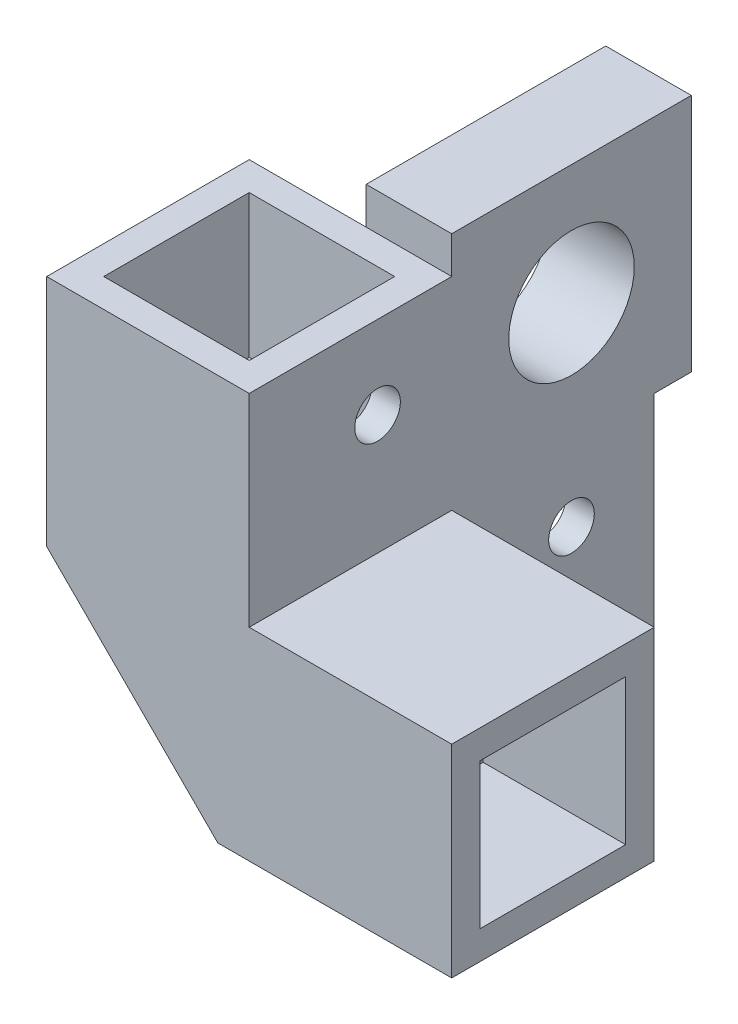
ISO-10303-21;
HEADER;
FILE_DESCRIPTION(('STEP AP214'),'2;1');
FILE_NAME('part.step','',(''),(''),'','','');
FILE_SCHEMA(('AUTOMOTIVE_DESIGN { 1 0 10303 214 1 1 1 1 }'));
ENDSEC;
DATA;
#1=APPLICATION_CONTEXT('core data for automotive mechanical design processes');
#2=APPLICATION_PROTOCOL_DEFINITION('international standard','automotive_design',2000,#1);
#3=PRODUCT_CONTEXT('',#1,'mechanical');
#4=PRODUCT('Part','Part','',(#3));
#5=PRODUCT_RELATED_PRODUCT_CATEGORY('part','',(#4));
#6=PRODUCT_DEFINITION_FORMATION('','',#4);
#7=PRODUCT_DEFINITION_CONTEXT('part definition',#1,'design');
#8=PRODUCT_DEFINITION('design','',#6,#7);
#9=PRODUCT_DEFINITION_SHAPE('','',#8);
#10=(LENGTH_UNIT() NAMED_UNIT(*) SI_UNIT(.MILLI.,.METRE.));
#11=(NAMED_UNIT(*) PLANE_ANGLE_UNIT() SI_UNIT($,.RADIAN.));
#12=(NAMED_UNIT(*) SI_UNIT($,.STERADIAN.) SOLID_ANGLE_UNIT());
#13=UNCERTAINTY_MEASURE_WITH_UNIT(LENGTH_MEASURE(1.E-05),#10,'distance_accuracy_value','');
#14=(GEOMETRIC_REPRESENTATION_CONTEXT(3) GLOBAL_UNCERTAINTY_ASSIGNED_CONTEXT((#13)) GLOBAL_UNIT_ASSIGNED_CONTEXT((#10,
#11,#12)) REPRESENTATION_CONTEXT('',''));
#15=CARTESIAN_POINT('',(0.,0.,0.));
#16=DIRECTION('',(0.,0.,1.));
#17=DIRECTION('',(1.,0.,0.));
#18=AXIS2_PLACEMENT_3D('',#15,#16,#17);
#19=CARTESIAN_POINT('',(0.,35.5,0.));
#20=DIRECTION('',(0.,-1.,0.));
#21=DIRECTION('',(0.,0.,-1.));
#22=AXIS2_PLACEMENT_3D('',#19,#20,#21);
#23=PLANE('',#22);
#24=DIRECTION('',(0.,0.,-1.));
#25=VECTOR('',#24,1.);
#26=CARTESIAN_POINT('',(2.75,35.5,-17.75));
#27=LINE('',#26,#25);
#28=CARTESIAN_POINT('',(2.75,35.5,-17.75));
#29=VERTEX_POINT('',#28);
#30=CARTESIAN_POINT('',(2.75,35.5,-53.25));
#31=VERTEX_POINT('',#30);
#32=EDGE_CURVE('E211',#29,#31,#27,.T.);
#33=ORIENTED_EDGE('',*,*,#32,.T.);
#34=DIRECTION('',(-1.,0.,0.));
#35=VECTOR('',#34,1.);
#36=CARTESIAN_POINT('',(-17.75,35.5,-53.25));
#37=LINE('',#36,#35);
#38=CARTESIAN_POINT('',(-17.75,35.5,-53.25));
#39=VERTEX_POINT('',#38);
#40=EDGE_CURVE('E254',#31,#39,#37,.T.);
#41=ORIENTED_EDGE('',*,*,#40,.T.);
#42=DIRECTION('',(0.,0.,1.));
#43=VECTOR('',#42,1.);
#44=CARTESIAN_POINT('',(-17.75,35.5,-17.75));
#45=LINE('',#44,#43);
#46=CARTESIAN_POINT('',(-17.75,35.5,-17.75));
#47=VERTEX_POINT('',#46);
#48=EDGE_CURVE('E233',#39,#47,#45,.T.);
#49=ORIENTED_EDGE('',*,*,#48,.T.);
#50=DIRECTION('',(-1.,0.,0.));
#51=VECTOR('',#50,1.);
#52=CARTESIAN_POINT('',(-17.75,35.5,-17.75));
#53=LINE('',#52,#51);
#54=EDGE_CURVE('E226',#29,#47,#53,.T.);
#55=ORIENTED_EDGE('',*,*,#54,.F.);
#56=EDGE_LOOP('',(#33,#41,#49,#55));
#57=FACE_BOUND('',#56,.T.);
#58=ADVANCED_FACE('F37',(#57),#23,.F.);
#59=CARTESIAN_POINT('',(-17.75,71.,-17.75));
#60=DIRECTION('',(0.,0.,1.));
#61=DIRECTION('',(1.,0.,0.));
#62=AXIS2_PLACEMENT_3D('',#59,#60,#61);
#63=PLANE('',#62);
#64=DIRECTION('',(0.,-1.,0.));
#65=VECTOR('',#64,1.);
#66=CARTESIAN_POINT('',(2.75,71.,-17.75));
#67=LINE('',#66,#65);
#68=CARTESIAN_POINT('',(2.75,71.,-17.75));
#69=VERTEX_POINT('',#68);
#70=EDGE_CURVE('E214',#69,#29,#67,.T.);
#71=ORIENTED_EDGE('',*,*,#70,.T.);
#72=ORIENTED_EDGE('',*,*,#54,.T.);
#73=DIRECTION('',(0.,-1.,0.));
#74=VECTOR('',#73,1.);
#75=CARTESIAN_POINT('',(-17.75,71.,-17.75));
#76=LINE('',#75,#74);
#77=CARTESIAN_POINT('',(-17.75,71.,-17.75));
#78=VERTEX_POINT('',#77);
#79=EDGE_CURVE('E248',#78,#47,#76,.T.);
#80=ORIENTED_EDGE('',*,*,#79,.F.);
#81=DIRECTION('',(-1.,0.,0.));
#82=VECTOR('',#81,1.);
#83=CARTESIAN_POINT('',(-17.75,71.,-17.75));
#84=LINE('',#83,#82);
#85=EDGE_CURVE('E228',#69,#78,#84,.T.);
#86=ORIENTED_EDGE('',*,*,#85,.F.);
#87=EDGE_LOOP('',(#71,#72,#80,#86));
#88=FACE_BOUND('',#87,.T.);
#89=ADVANCED_FACE('F224',(#88),#63,.F.);
#90=CARTESIAN_POINT('',(0.,0.,0.));
#91=DIRECTION('',(0.,-1.,0.));
#92=DIRECTION('',(0.,0.,-1.));
#93=AXIS2_PLACEMENT_3D('',#90,#91,#92);
#94=PLANE('',#93);
#95=DIRECTION('',(1.,0.,0.));
#96=VECTOR('',#95,1.);
#97=CARTESIAN_POINT('',(53.25,0.,17.75));
#98=LINE('',#97,#96);
#99=CARTESIAN_POINT('',(12.25,0.,17.75));
#100=VERTEX_POINT('',#99);
#101=CARTESIAN_POINT('',(53.25,0.,17.75));
#102=VERTEX_POINT('',#101);
#103=EDGE_CURVE('E274',#100,#102,#98,.T.);
#104=ORIENTED_EDGE('',*,*,#103,.F.);
#105=DIRECTION('',(-0.707106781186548,0.,-0.707106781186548));
#106=VECTOR('',#105,1.);
#107=CARTESIAN_POINT('',(-2.75,0.,2.75));
#108=LINE('',#107,#106);
#109=CARTESIAN_POINT('',(-17.75,0.,-12.25));
#110=VERTEX_POINT('',#109);
#111=EDGE_CURVE('E11',#100,#110,#108,.T.);
#112=ORIENTED_EDGE('',*,*,#111,.T.);
#113=DIRECTION('',(0.,0.,1.));
#114=VECTOR('',#113,1.);
#115=CARTESIAN_POINT('',(-17.75,0.,17.75));
#116=LINE('',#115,#114);
#117=CARTESIAN_POINT('',(-17.75,0.,-53.25));
#118=VERTEX_POINT('',#117);
#119=EDGE_CURVE('E271',#118,#110,#116,.T.);
#120=ORIENTED_EDGE('',*,*,#119,.F.);
#121=DIRECTION('',(-1.,0.,0.));
#122=VECTOR('',#121,1.);
#123=CARTESIAN_POINT('',(-17.75,0.,-53.25));
#124=LINE('',#123,#122);
#125=CARTESIAN_POINT('',(17.75,0.,-53.25));
#126=VERTEX_POINT('',#125);
#127=EDGE_CURVE('E268',#126,#118,#124,.T.);
#128=ORIENTED_EDGE('',*,*,#127,.F.);
#129=DIRECTION('',(0.,0.,-1.));
#130=VECTOR('',#129,1.);
#131=CARTESIAN_POINT('',(17.75,0.,-53.25));
#132=LINE('',#131,#130);
#133=CARTESIAN_POINT('',(17.75,0.,-17.75));
#134=VERTEX_POINT('',#133);
#135=EDGE_CURVE('E266',#134,#126,#132,.T.);
#136=ORIENTED_EDGE('',*,*,#135,.F.);
#137=DIRECTION('',(-1.,0.,0.));
#138=VECTOR('',#137,1.);
#139=CARTESIAN_POINT('',(17.75,0.,-17.75));
#140=LINE('',#139,#138);
#141=CARTESIAN_POINT('',(53.25,0.,-17.75));
#142=VERTEX_POINT('',#141);
#143=EDGE_CURVE('E251',#142,#134,#140,.T.);
#144=ORIENTED_EDGE('',*,*,#143,.F.);
#145=DIRECTION('',(0.,0.,-1.));
#146=VECTOR('',#145,1.);
#147=CARTESIAN_POINT('',(53.25,0.,-17.75));
#148=LINE('',#147,#146);
#149=EDGE_CURVE('E255',#102,#142,#148,.T.);
#150=ORIENTED_EDGE('',*,*,#149,.F.);
#151=EDGE_LOOP('',(#104,#112,#120,#128,#136,#144,#150));
#152=FACE_BOUND('',#151,.T.);
#153=ADVANCED_FACE('F458',(#152),#94,.T.);
#154=DIRECTION('',(0.,0.,-1.));
#155=VECTOR('',#154,1.);
#156=CARTESIAN_POINT('',(17.75,35.5,17.75));
#157=LINE('',#156,#155);
#158=CARTESIAN_POINT('',(17.75,35.5,17.75));
#159=VERTEX_POINT('',#158);
#160=CARTESIAN_POINT('',(17.75,35.5,-17.75));
#161=VERTEX_POINT('',#160);
#162=EDGE_CURVE('E236',#159,#161,#157,.T.);
#163=ORIENTED_EDGE('',*,*,#162,.F.);
#164=DIRECTION('',(1.,0.,0.));
#165=VECTOR('',#164,1.);
#166=CARTESIAN_POINT('',(-17.75,35.5,17.75));
#167=LINE('',#166,#165);
#168=CARTESIAN_POINT('',(53.25,35.5,17.75));
#169=VERTEX_POINT('',#168);
#170=EDGE_CURVE('E259',#159,#169,#167,.T.);
#171=ORIENTED_EDGE('',*,*,#170,.T.);
#172=DIRECTION('',(0.,0.,-1.));
#173=VECTOR('',#172,1.);
#174=CARTESIAN_POINT('',(53.25,35.5,-17.75));
#175=LINE('',#174,#173);
#176=CARTESIAN_POINT('',(53.25,35.5,-17.75));
#177=VERTEX_POINT('',#176);
#178=EDGE_CURVE('E261',#169,#177,#175,.T.);
#179=ORIENTED_EDGE('',*,*,#178,.T.);
#180=DIRECTION('',(-1.,0.,0.));
#181=VECTOR('',#180,1.);
#182=CARTESIAN_POINT('',(17.75,35.5,-17.75));
#183=LINE('',#182,#181);
#184=EDGE_CURVE('E252',#177,#161,#183,.T.);
#185=ORIENTED_EDGE('',*,*,#184,.T.);
#186=EDGE_LOOP('',(#163,#171,#179,#185));
#187=FACE_BOUND('',#186,.T.);
#188=ADVANCED_FACE('F468',(#187),#23,.F.);
#189=CARTESIAN_POINT('',(17.75,35.5,-17.75));
#190=DIRECTION('',(0.,0.,1.));
#191=DIRECTION('',(1.,0.,0.));
#192=AXIS2_PLACEMENT_3D('',#189,#190,#191);
#193=PLANE('',#192);
#194=ORIENTED_EDGE('',*,*,#143,.T.);
#195=DIRECTION('',(0.,-1.,0.));
#196=VECTOR('',#195,1.);
#197=CARTESIAN_POINT('',(17.75,35.5,-17.75));
#198=LINE('',#197,#196);
#199=EDGE_CURVE('E291',#161,#134,#198,.T.);
#200=ORIENTED_EDGE('',*,*,#199,.F.);
#201=ORIENTED_EDGE('',*,*,#184,.F.);
#202=DIRECTION('',(0.,-1.,0.));
#203=VECTOR('',#202,1.);
#204=CARTESIAN_POINT('',(53.25,35.5,-17.75));
#205=LINE('',#204,#203);
#206=EDGE_CURVE('E263',#177,#142,#205,.T.);
#207=ORIENTED_EDGE('',*,*,#206,.T.);
#208=EDGE_LOOP('',(#194,#200,#201,#207));
#209=FACE_BOUND('',#208,.T.);
#210=ADVANCED_FACE('F39',(#209),#193,.F.);
#211=CARTESIAN_POINT('',(17.75,35.5,-53.25));
#212=DIRECTION('',(-1.,0.,0.));
#213=DIRECTION('',(0.,0.,1.));
#214=AXIS2_PLACEMENT_3D('',#211,#212,#213);
#215=PLANE('',#214);
#216=CARTESIAN_POINT('',(17.75,22.5,-38.75));
#217=DIRECTION('',(1.,0.,0.));
#218=DIRECTION('',(0.,0.,-1.));
#219=AXIS2_PLACEMENT_3D('',#216,#217,#218);
#220=CIRCLE('',#219,4.);
#221=CARTESIAN_POINT('',(17.75,22.5,-42.75));
#222=VERTEX_POINT('',#221);
#223=EDGE_CURVE('E297',#222,#222,#220,.T.);
#224=ORIENTED_EDGE('',*,*,#223,.F.);
#225=EDGE_LOOP('',(#224));
#226=FACE_BOUND('',#225,.T.);
#227=CARTESIAN_POINT('',(17.75,56.5,-4.75));
#228=DIRECTION('',(1.,0.,0.));
#229=DIRECTION('',(0.,0.,-1.));
#230=AXIS2_PLACEMENT_3D('',#227,#228,#229);
#231=CIRCLE('',#230,4.);
#232=CARTESIAN_POINT('',(17.75,56.5,-8.75000000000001));
#233=VERTEX_POINT('',#232);
#234=EDGE_CURVE('E303',#233,#233,#231,.T.);
#235=ORIENTED_EDGE('',*,*,#234,.F.);
#236=EDGE_LOOP('',(#235));
#237=FACE_BOUND('',#236,.T.);
#238=ORIENTED_EDGE('',*,*,#135,.T.);
#239=DIRECTION('',(0.,-1.,0.));
#240=VECTOR('',#239,1.);
#241=CARTESIAN_POINT('',(17.75,35.5,-53.25));
#242=LINE('',#241,#240);
#243=CARTESIAN_POINT('',(17.75,35.5,-53.25));
#244=VERTEX_POINT('',#243);
#245=EDGE_CURVE('E288',#244,#126,#242,.T.);
#246=ORIENTED_EDGE('',*,*,#245,.F.);
#247=DIRECTION('',(0.,0.,-1.));
#248=VECTOR('',#247,1.);
#249=CARTESIAN_POINT('',(17.75,35.5,-59.75));
#250=LINE('',#249,#248);
#251=CARTESIAN_POINT('',(17.75,35.5,-59.75));
#252=VERTEX_POINT('',#251);
#253=EDGE_CURVE('E313',#244,#252,#250,.T.);
#254=ORIENTED_EDGE('',*,*,#253,.T.);
#255=DIRECTION('',(0.,1.,0.));
#256=VECTOR('',#255,1.);
#257=CARTESIAN_POINT('',(17.75,77.5,-59.75));
#258=LINE('',#257,#256);
#259=CARTESIAN_POINT('',(17.75,77.5,-59.75));
#260=VERTEX_POINT('',#259);
#261=EDGE_CURVE('E323',#252,#260,#258,.T.);
#262=ORIENTED_EDGE('',*,*,#261,.T.);
#263=DIRECTION('',(0.,0.,1.));
#264=VECTOR('',#263,1.);
#265=CARTESIAN_POINT('',(17.75,77.5,-17.75));
#266=LINE('',#265,#264);
#267=CARTESIAN_POINT('',(17.75,77.5,-17.75));
#268=VERTEX_POINT('',#267);
#269=EDGE_CURVE('E326',#260,#268,#266,.T.);
#270=ORIENTED_EDGE('',*,*,#269,.T.);
#271=DIRECTION('',(0.,-1.,0.));
#272=VECTOR('',#271,1.);
#273=CARTESIAN_POINT('',(17.75,71.,-17.75));
#274=LINE('',#273,#272);
#275=CARTESIAN_POINT('',(17.75,71.,-17.75));
#276=VERTEX_POINT('',#275);
#277=EDGE_CURVE('E230',#268,#276,#274,.T.);
#278=ORIENTED_EDGE('',*,*,#277,.T.);
#279=DIRECTION('',(0.,0.,-1.));
#280=VECTOR('',#279,1.);
#281=CARTESIAN_POINT('',(17.75,71.,17.75));
#282=LINE('',#281,#280);
#283=CARTESIAN_POINT('',(17.75,71.,17.75));
#284=VERTEX_POINT('',#283);
#285=EDGE_CURVE('E235',#284,#276,#282,.T.);
#286=ORIENTED_EDGE('',*,*,#285,.F.);
#287=DIRECTION('',(0.,-1.,0.));
#288=VECTOR('',#287,1.);
#289=CARTESIAN_POINT('',(17.75,71.,17.75));
#290=LINE('',#289,#288);
#291=EDGE_CURVE('E245',#284,#159,#290,.T.);
#292=ORIENTED_EDGE('',*,*,#291,.T.);
#293=ORIENTED_EDGE('',*,*,#162,.T.);
#294=ORIENTED_EDGE('',*,*,#199,.T.);
#295=EDGE_LOOP('',(#238,#246,#254,#262,#270,#278,#286,#292,#293,#294));
#296=FACE_BOUND('',#295,.T.);
#297=CARTESIAN_POINT('',(17.75,56.5,-38.75));
#298=DIRECTION('',(1.,0.,0.));
#299=DIRECTION('',(0.,0.,-1.));
#300=AXIS2_PLACEMENT_3D('',#297,#298,#299);
#301=CIRCLE('',#300,11.);
#302=CARTESIAN_POINT('',(17.75,56.5,-49.75));
#303=VERTEX_POINT('',#302);
#304=EDGE_CURVE('E301',#303,#303,#301,.T.);
#305=ORIENTED_EDGE('',*,*,#304,.F.);
#306=EDGE_LOOP('',(#305));
#307=FACE_BOUND('',#306,.T.);
#308=ADVANCED_FACE('F448',(#226,#237,#296,#307),#215,.F.);
#309=CARTESIAN_POINT('',(-17.75,35.5,-53.25));
#310=DIRECTION('',(0.,0.,1.));
#311=DIRECTION('',(1.,0.,0.));
#312=AXIS2_PLACEMENT_3D('',#309,#310,#311);
#313=PLANE('',#312);
#314=DIRECTION('',(-1.,0.,0.));
#315=VECTOR('',#314,1.);
#316=CARTESIAN_POINT('',(12.75,5.,-53.25));
#317=LINE('',#316,#315);
#318=CARTESIAN_POINT('',(12.75,5.,-53.25));
#319=VERTEX_POINT('',#318);
#320=CARTESIAN_POINT('',(-12.75,5.,-53.25));
#321=VERTEX_POINT('',#320);
#322=EDGE_CURVE('E353',#319,#321,#317,.T.);
#323=ORIENTED_EDGE('',*,*,#322,.F.);
#324=DIRECTION('',(0.,-1.,0.));
#325=VECTOR('',#324,1.);
#326=CARTESIAN_POINT('',(12.75,30.5,-53.25));
#327=LINE('',#326,#325);
#328=CARTESIAN_POINT('',(12.75,30.5,-53.25));
#329=VERTEX_POINT('',#328);
#330=EDGE_CURVE('E333',#329,#319,#327,.T.);
#331=ORIENTED_EDGE('',*,*,#330,.F.);
#332=DIRECTION('',(1.,0.,0.));
#333=VECTOR('',#332,1.);
#334=CARTESIAN_POINT('',(-12.75,30.5,-53.25));
#335=LINE('',#334,#333);
#336=CARTESIAN_POINT('',(-12.75,30.5,-53.25));
#337=VERTEX_POINT('',#336);
#338=EDGE_CURVE('E342',#337,#329,#335,.T.);
#339=ORIENTED_EDGE('',*,*,#338,.F.);
#340=DIRECTION('',(0.,1.,0.));
#341=VECTOR('',#340,1.);
#342=CARTESIAN_POINT('',(-12.75,5.,-53.25));
#343=LINE('',#342,#341);
#344=EDGE_CURVE('E356',#321,#337,#343,.T.);
#345=ORIENTED_EDGE('',*,*,#344,.F.);
#346=EDGE_LOOP('',(#323,#331,#339,#345));
#347=FACE_BOUND('',#346,.T.);
#348=ORIENTED_EDGE('',*,*,#127,.T.);
#349=DIRECTION('',(0.,-1.,0.));
#350=VECTOR('',#349,1.);
#351=CARTESIAN_POINT('',(-17.75,35.5,-53.25));
#352=LINE('',#351,#350);
#353=EDGE_CURVE('E285',#39,#118,#352,.T.);
#354=ORIENTED_EDGE('',*,*,#353,.F.);
#355=ORIENTED_EDGE('',*,*,#40,.F.);
#356=EDGE_CURVE('E256',#244,#31,#37,.T.);
#357=ORIENTED_EDGE('',*,*,#356,.F.);
#358=ORIENTED_EDGE('',*,*,#245,.T.);
#359=EDGE_LOOP('',(#348,#354,#355,#357,#358));
#360=FACE_BOUND('',#359,.T.);
#361=ADVANCED_FACE('F473',(#347,#360),#313,.F.);
#362=CARTESIAN_POINT('',(-17.75,35.5,17.75));
#363=DIRECTION('',(1.,0.,0.));
#364=DIRECTION('',(0.,0.,-1.));
#365=AXIS2_PLACEMENT_3D('',#362,#363,#364);
#366=PLANE('',#365);
#367=DIRECTION('',(0.,-0.707106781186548,-0.707106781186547));
#368=VECTOR('',#367,1.);
#369=CARTESIAN_POINT('',(-17.75,32.75,20.5));
#370=LINE('',#369,#368);
#371=CARTESIAN_POINT('',(-17.75,30.,17.75));
#372=VERTEX_POINT('',#371);
#373=EDGE_CURVE('E62',#372,#110,#370,.T.);
#374=ORIENTED_EDGE('',*,*,#373,.F.);
#375=DIRECTION('',(0.,-1.,0.));
#376=VECTOR('',#375,1.);
#377=CARTESIAN_POINT('',(-17.75,35.5,17.75));
#378=LINE('',#377,#376);
#379=CARTESIAN_POINT('',(-17.75,71.,17.75));
#380=VERTEX_POINT('',#379);
#381=EDGE_CURVE('E282',#380,#372,#378,.T.);
#382=ORIENTED_EDGE('',*,*,#381,.F.);
#383=DIRECTION('',(0.,0.,1.));
#384=VECTOR('',#383,1.);
#385=CARTESIAN_POINT('',(-17.75,71.,17.75));
#386=LINE('',#385,#384);
#387=EDGE_CURVE('E434',#78,#380,#386,.T.);
#388=ORIENTED_EDGE('',*,*,#387,.F.);
#389=ORIENTED_EDGE('',*,*,#79,.T.);
#390=ORIENTED_EDGE('',*,*,#48,.F.);
#391=ORIENTED_EDGE('',*,*,#353,.T.);
#392=ORIENTED_EDGE('',*,*,#119,.T.);
#393=EDGE_LOOP('',(#374,#382,#388,#389,#390,#391,#392));
#394=FACE_BOUND('',#393,.T.);
#395=ADVANCED_FACE('F454',(#394),#366,.F.);
#396=CARTESIAN_POINT('',(53.25,35.5,17.75));
#397=DIRECTION('',(0.,0.,-1.));
#398=DIRECTION('',(-1.,0.,0.));
#399=AXIS2_PLACEMENT_3D('',#396,#397,#398);
#400=PLANE('',#399);
#401=DIRECTION('',(-0.707106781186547,0.707106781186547,0.));
#402=VECTOR('',#401,1.);
#403=CARTESIAN_POINT('',(15.,-2.74999999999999,17.75));
#404=LINE('',#403,#402);
#405=EDGE_CURVE('E46',#100,#372,#404,.T.);
#406=ORIENTED_EDGE('',*,*,#405,.F.);
#407=ORIENTED_EDGE('',*,*,#103,.T.);
#408=DIRECTION('',(0.,-1.,0.));
#409=VECTOR('',#408,1.);
#410=CARTESIAN_POINT('',(53.25,35.5,17.75));
#411=LINE('',#410,#409);
#412=EDGE_CURVE('E279',#169,#102,#411,.T.);
#413=ORIENTED_EDGE('',*,*,#412,.F.);
#414=ORIENTED_EDGE('',*,*,#170,.F.);
#415=ORIENTED_EDGE('',*,*,#291,.F.);
#416=DIRECTION('',(1.,0.,0.));
#417=VECTOR('',#416,1.);
#418=CARTESIAN_POINT('',(-17.75,71.,17.75));
#419=LINE('',#418,#417);
#420=EDGE_CURVE('E249',#380,#284,#419,.T.);
#421=ORIENTED_EDGE('',*,*,#420,.F.);
#422=ORIENTED_EDGE('',*,*,#381,.T.);
#423=EDGE_LOOP('',(#406,#407,#413,#414,#415,#421,#422));
#424=FACE_BOUND('',#423,.T.);
#425=ADVANCED_FACE('F445',(#424),#400,.F.);
#426=CARTESIAN_POINT('',(53.25,35.5,-17.75));
#427=DIRECTION('',(-1.,0.,0.));
#428=DIRECTION('',(0.,0.,1.));
#429=AXIS2_PLACEMENT_3D('',#426,#427,#428);
#430=PLANE('',#429);
#431=DIRECTION('',(0.,0.,-1.));
#432=VECTOR('',#431,1.);
#433=CARTESIAN_POINT('',(53.25,5.,12.75));
#434=LINE('',#433,#432);
#435=CARTESIAN_POINT('',(53.25,5.,12.75));
#436=VERTEX_POINT('',#435);
#437=CARTESIAN_POINT('',(53.25,5.,-12.75));
#438=VERTEX_POINT('',#437);
#439=EDGE_CURVE('E417',#436,#438,#434,.T.);
#440=ORIENTED_EDGE('',*,*,#439,.F.);
#441=DIRECTION('',(0.,-1.,0.));
#442=VECTOR('',#441,1.);
#443=CARTESIAN_POINT('',(53.25,30.5,12.75));
#444=LINE('',#443,#442);
#445=CARTESIAN_POINT('',(53.25,30.5,12.75));
#446=VERTEX_POINT('',#445);
#447=EDGE_CURVE('E395',#446,#436,#444,.T.);
#448=ORIENTED_EDGE('',*,*,#447,.F.);
#449=DIRECTION('',(0.,0.,1.));
#450=VECTOR('',#449,1.);
#451=CARTESIAN_POINT('',(53.25,30.5,-12.75));
#452=LINE('',#451,#450);
#453=CARTESIAN_POINT('',(53.25,30.5,-12.75));
#454=VERTEX_POINT('',#453);
#455=EDGE_CURVE('E406',#454,#446,#452,.T.);
#456=ORIENTED_EDGE('',*,*,#455,.F.);
#457=DIRECTION('',(0.,1.,0.));
#458=VECTOR('',#457,1.);
#459=CARTESIAN_POINT('',(53.25,5.,-12.75));
#460=LINE('',#459,#458);
#461=EDGE_CURVE('E420',#438,#454,#460,.T.);
#462=ORIENTED_EDGE('',*,*,#461,.F.);
#463=EDGE_LOOP('',(#440,#448,#456,#462));
#464=FACE_BOUND('',#463,.T.);
#465=ORIENTED_EDGE('',*,*,#149,.T.);
#466=ORIENTED_EDGE('',*,*,#206,.F.);
#467=ORIENTED_EDGE('',*,*,#178,.F.);
#468=ORIENTED_EDGE('',*,*,#412,.T.);
#469=EDGE_LOOP('',(#465,#466,#467,#468));
#470=FACE_BOUND('',#469,.T.);
#471=ADVANCED_FACE('F462',(#464,#470),#430,.F.);
#472=CARTESIAN_POINT('',(0.,71.,0.));
#473=DIRECTION('',(0.,-1.,0.));
#474=DIRECTION('',(0.,0.,-1.));
#475=AXIS2_PLACEMENT_3D('',#472,#473,#474);
#476=PLANE('',#475);
#477=DIRECTION('',(0.,0.,-1.));
#478=VECTOR('',#477,1.);
#479=CARTESIAN_POINT('',(12.75,71.,12.75));
#480=LINE('',#479,#478);
#481=CARTESIAN_POINT('',(12.75,71.,12.75));
#482=VERTEX_POINT('',#481);
#483=CARTESIAN_POINT('',(12.75,71.,-12.75));
#484=VERTEX_POINT('',#483);
#485=EDGE_CURVE('E385',#482,#484,#480,.T.);
#486=ORIENTED_EDGE('',*,*,#485,.F.);
#487=DIRECTION('',(1.,0.,0.));
#488=VECTOR('',#487,1.);
#489=CARTESIAN_POINT('',(-12.75,71.,12.75));
#490=LINE('',#489,#488);
#491=CARTESIAN_POINT('',(-12.75,71.,12.75));
#492=VERTEX_POINT('',#491);
#493=EDGE_CURVE('E363',#492,#482,#490,.T.);
#494=ORIENTED_EDGE('',*,*,#493,.F.);
#495=DIRECTION('',(0.,0.,1.));
#496=VECTOR('',#495,1.);
#497=CARTESIAN_POINT('',(-12.75,71.,-12.75));
#498=LINE('',#497,#496);
#499=CARTESIAN_POINT('',(-12.75,71.,-12.75));
#500=VERTEX_POINT('',#499);
#501=EDGE_CURVE('E374',#500,#492,#498,.T.);
#502=ORIENTED_EDGE('',*,*,#501,.F.);
#503=DIRECTION('',(-1.,0.,0.));
#504=VECTOR('',#503,1.);
#505=CARTESIAN_POINT('',(12.75,71.,-12.75));
#506=LINE('',#505,#504);
#507=EDGE_CURVE('E388',#484,#500,#506,.T.);
#508=ORIENTED_EDGE('',*,*,#507,.F.);
#509=EDGE_LOOP('',(#486,#494,#502,#508));
#510=FACE_BOUND('',#509,.T.);
#511=ORIENTED_EDGE('',*,*,#285,.T.);
#512=EDGE_CURVE('E432',#276,#69,#84,.T.);
#513=ORIENTED_EDGE('',*,*,#512,.T.);
#514=ORIENTED_EDGE('',*,*,#85,.T.);
#515=ORIENTED_EDGE('',*,*,#387,.T.);
#516=ORIENTED_EDGE('',*,*,#420,.T.);
#517=EDGE_LOOP('',(#511,#513,#514,#515,#516));
#518=FACE_BOUND('',#517,.T.);
#519=ADVANCED_FACE('F439',(#510,#518),#476,.F.);
#520=CARTESIAN_POINT('',(28.25,30.5,12.75));
#521=DIRECTION('',(0.,0.,1.));
#522=DIRECTION('',(1.,0.,0.));
#523=AXIS2_PLACEMENT_3D('',#520,#521,#522);
#524=PLANE('',#523);
#525=ORIENTED_EDGE('',*,*,#447,.T.);
#526=DIRECTION('',(1.,0.,0.));
#527=VECTOR('',#526,1.);
#528=CARTESIAN_POINT('',(28.25,5.,12.75));
#529=LINE('',#528,#527);
#530=CARTESIAN_POINT('',(28.25,5.,12.75));
#531=VERTEX_POINT('',#530);
#532=EDGE_CURVE('E415',#531,#436,#529,.T.);
#533=ORIENTED_EDGE('',*,*,#532,.F.);
#534=DIRECTION('',(0.,-1.,0.));
#535=VECTOR('',#534,1.);
#536=CARTESIAN_POINT('',(28.25,30.5,12.75));
#537=LINE('',#536,#535);
#538=CARTESIAN_POINT('',(28.25,30.5,12.75));
#539=VERTEX_POINT('',#538);
#540=EDGE_CURVE('E402',#539,#531,#537,.T.);
#541=ORIENTED_EDGE('',*,*,#540,.F.);
#542=DIRECTION('',(1.,0.,0.));
#543=VECTOR('',#542,1.);
#544=CARTESIAN_POINT('',(28.25,30.5,12.75));
#545=LINE('',#544,#543);
#546=EDGE_CURVE('E241',#539,#446,#545,.T.);
#547=ORIENTED_EDGE('',*,*,#546,.T.);
#548=EDGE_LOOP('',(#525,#533,#541,#547));
#549=FACE_BOUND('',#548,.T.);
#550=ADVANCED_FACE('F571',(#549),#524,.F.);
#551=CARTESIAN_POINT('',(28.25,30.5,-12.75));
#552=DIRECTION('',(0.,1.,0.));
#553=DIRECTION('',(0.,0.,1.));
#554=AXIS2_PLACEMENT_3D('',#551,#552,#553);
#555=PLANE('',#554);
#556=ORIENTED_EDGE('',*,*,#455,.T.);
#557=ORIENTED_EDGE('',*,*,#546,.F.);
#558=DIRECTION('',(0.,0.,1.));
#559=VECTOR('',#558,1.);
#560=CARTESIAN_POINT('',(28.25,30.5,-12.75));
#561=LINE('',#560,#559);
#562=CARTESIAN_POINT('',(28.25,30.5,-12.75));
#563=VERTEX_POINT('',#562);
#564=EDGE_CURVE('E412',#563,#539,#561,.T.);
#565=ORIENTED_EDGE('',*,*,#564,.F.);
#566=DIRECTION('',(1.,0.,0.));
#567=VECTOR('',#566,1.);
#568=CARTESIAN_POINT('',(28.25,30.5,-12.75));
#569=LINE('',#568,#567);
#570=EDGE_CURVE('E426',#563,#454,#569,.T.);
#571=ORIENTED_EDGE('',*,*,#570,.T.);
#572=EDGE_LOOP('',(#556,#557,#565,#571));
#573=FACE_BOUND('',#572,.T.);
#574=ADVANCED_FACE('F567',(#573),#555,.F.);
#575=CARTESIAN_POINT('',(28.25,5.,-12.75));
#576=DIRECTION('',(0.,0.,-1.));
#577=DIRECTION('',(-1.,0.,0.));
#578=AXIS2_PLACEMENT_3D('',#575,#576,#577);
#579=PLANE('',#578);
#580=ORIENTED_EDGE('',*,*,#461,.T.);
#581=ORIENTED_EDGE('',*,*,#570,.F.);
#582=DIRECTION('',(0.,1.,0.));
#583=VECTOR('',#582,1.);
#584=CARTESIAN_POINT('',(28.25,5.,-12.75));
#585=LINE('',#584,#583);
#586=CARTESIAN_POINT('',(28.25,5.,-12.75));
#587=VERTEX_POINT('',#586);
#588=EDGE_CURVE('E409',#587,#563,#585,.T.);
#589=ORIENTED_EDGE('',*,*,#588,.F.);
#590=DIRECTION('',(1.,0.,0.));
#591=VECTOR('',#590,1.);
#592=CARTESIAN_POINT('',(28.25,5.,-12.75));
#593=LINE('',#592,#591);
#594=EDGE_CURVE('E428',#587,#438,#593,.T.);
#595=ORIENTED_EDGE('',*,*,#594,.T.);
#596=EDGE_LOOP('',(#580,#581,#589,#595));
#597=FACE_BOUND('',#596,.T.);
#598=ADVANCED_FACE('F570',(#597),#579,.F.);
#599=CARTESIAN_POINT('',(28.25,5.,12.75));
#600=DIRECTION('',(0.,-1.,0.));
#601=DIRECTION('',(0.,0.,-1.));
#602=AXIS2_PLACEMENT_3D('',#599,#600,#601);
#603=PLANE('',#602);
#604=ORIENTED_EDGE('',*,*,#439,.T.);
#605=ORIENTED_EDGE('',*,*,#594,.F.);
#606=DIRECTION('',(0.,0.,-1.));
#607=VECTOR('',#606,1.);
#608=CARTESIAN_POINT('',(28.25,5.,12.75));
#609=LINE('',#608,#607);
#610=EDGE_CURVE('E405',#531,#587,#609,.T.);
#611=ORIENTED_EDGE('',*,*,#610,.F.);
#612=ORIENTED_EDGE('',*,*,#532,.T.);
#613=EDGE_LOOP('',(#604,#605,#611,#612));
#614=FACE_BOUND('',#613,.T.);
#615=ADVANCED_FACE('F565',(#614),#603,.F.);
#616=CARTESIAN_POINT('',(28.25,0.,0.));
#617=DIRECTION('',(1.,0.,0.));
#618=DIRECTION('',(0.,0.,-1.));
#619=AXIS2_PLACEMENT_3D('',#616,#617,#618);
#620=PLANE('',#619);
#621=ORIENTED_EDGE('',*,*,#540,.T.);
#622=ORIENTED_EDGE('',*,*,#610,.T.);
#623=ORIENTED_EDGE('',*,*,#588,.T.);
#624=ORIENTED_EDGE('',*,*,#564,.T.);
#625=EDGE_LOOP('',(#621,#622,#623,#624));
#626=FACE_BOUND('',#625,.T.);
#627=ADVANCED_FACE('F558',(#626),#620,.T.);
#628=CARTESIAN_POINT('',(-12.75,46.,12.75));
#629=DIRECTION('',(0.,0.,1.));
#630=DIRECTION('',(1.,0.,0.));
#631=AXIS2_PLACEMENT_3D('',#628,#629,#630);
#632=PLANE('',#631);
#633=ORIENTED_EDGE('',*,*,#493,.T.);
#634=DIRECTION('',(0.,1.,0.));
#635=VECTOR('',#634,1.);
#636=CARTESIAN_POINT('',(12.75,46.,12.75));
#637=LINE('',#636,#635);
#638=CARTESIAN_POINT('',(12.75,46.,12.75));
#639=VERTEX_POINT('',#638);
#640=EDGE_CURVE('E383',#639,#482,#637,.T.);
#641=ORIENTED_EDGE('',*,*,#640,.F.);
#642=DIRECTION('',(1.,0.,0.));
#643=VECTOR('',#642,1.);
#644=CARTESIAN_POINT('',(-12.75,46.,12.75));
#645=LINE('',#644,#643);
#646=CARTESIAN_POINT('',(-12.75,46.,12.75));
#647=VERTEX_POINT('',#646);
#648=EDGE_CURVE('E370',#647,#639,#645,.T.);
#649=ORIENTED_EDGE('',*,*,#648,.F.);
#650=DIRECTION('',(0.,1.,0.));
#651=VECTOR('',#650,1.);
#652=CARTESIAN_POINT('',(-12.75,46.,12.75));
#653=LINE('',#652,#651);
#654=EDGE_CURVE('E393',#647,#492,#653,.T.);
#655=ORIENTED_EDGE('',*,*,#654,.T.);
#656=EDGE_LOOP('',(#633,#641,#649,#655));
#657=FACE_BOUND('',#656,.T.);
#658=ADVANCED_FACE('F548',(#657),#632,.F.);
#659=CARTESIAN_POINT('',(-12.75,46.,-12.75));
#660=DIRECTION('',(-1.,0.,0.));
#661=DIRECTION('',(0.,0.,1.));
#662=AXIS2_PLACEMENT_3D('',#659,#660,#661);
#663=PLANE('',#662);
#664=ORIENTED_EDGE('',*,*,#501,.T.);
#665=ORIENTED_EDGE('',*,*,#654,.F.);
#666=DIRECTION('',(0.,0.,1.));
#667=VECTOR('',#666,1.);
#668=CARTESIAN_POINT('',(-12.75,46.,-12.75));
#669=LINE('',#668,#667);
#670=CARTESIAN_POINT('',(-12.75,46.,-12.75));
#671=VERTEX_POINT('',#670);
#672=EDGE_CURVE('E380',#671,#647,#669,.T.);
#673=ORIENTED_EDGE('',*,*,#672,.F.);
#674=DIRECTION('',(0.,1.,0.));
#675=VECTOR('',#674,1.);
#676=CARTESIAN_POINT('',(-12.75,46.,-12.75));
#677=LINE('',#676,#675);
#678=EDGE_CURVE('E396',#671,#500,#677,.T.);
#679=ORIENTED_EDGE('',*,*,#678,.T.);
#680=EDGE_LOOP('',(#664,#665,#673,#679));
#681=FACE_BOUND('',#680,.T.);
#682=ADVANCED_FACE('F550',(#681),#663,.F.);
#683=CARTESIAN_POINT('',(12.75,46.,-12.75));
#684=DIRECTION('',(0.,0.,-1.));
#685=DIRECTION('',(-1.,0.,0.));
#686=AXIS2_PLACEMENT_3D('',#683,#684,#685);
#687=PLANE('',#686);
#688=ORIENTED_EDGE('',*,*,#507,.T.);
#689=ORIENTED_EDGE('',*,*,#678,.F.);
#690=DIRECTION('',(-1.,0.,0.));
#691=VECTOR('',#690,1.);
#692=CARTESIAN_POINT('',(12.75,46.,-12.75));
#693=LINE('',#692,#691);
#694=CARTESIAN_POINT('',(12.75,46.,-12.75));
#695=VERTEX_POINT('',#694);
#696=EDGE_CURVE('E377',#695,#671,#693,.T.);
#697=ORIENTED_EDGE('',*,*,#696,.F.);
#698=DIRECTION('',(0.,1.,0.));
#699=VECTOR('',#698,1.);
#700=CARTESIAN_POINT('',(12.75,46.,-12.75));
#701=LINE('',#700,#699);
#702=EDGE_CURVE('E398',#695,#484,#701,.T.);
#703=ORIENTED_EDGE('',*,*,#702,.T.);
#704=EDGE_LOOP('',(#688,#689,#697,#703));
#705=FACE_BOUND('',#704,.T.);
#706=ADVANCED_FACE('F534',(#705),#687,.F.);
#707=CARTESIAN_POINT('',(12.75,46.,12.75));
#708=DIRECTION('',(1.,0.,0.));
#709=DIRECTION('',(0.,0.,-1.));
#710=AXIS2_PLACEMENT_3D('',#707,#708,#709);
#711=PLANE('',#710);
#712=CARTESIAN_POINT('',(12.75,56.5,-4.75000000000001));
#713=DIRECTION('',(1.,0.,0.));
#714=DIRECTION('',(0.,0.,-1.));
#715=AXIS2_PLACEMENT_3D('',#712,#713,#714);
#716=CIRCLE('',#715,4.);
#717=CARTESIAN_POINT('',(12.75,56.5,-8.75000000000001));
#718=VERTEX_POINT('',#717);
#719=EDGE_CURVE('E41',#718,#718,#716,.T.);
#720=ORIENTED_EDGE('',*,*,#719,.T.);
#721=EDGE_LOOP('',(#720));
#722=FACE_BOUND('',#721,.T.);
#723=ORIENTED_EDGE('',*,*,#485,.T.);
#724=ORIENTED_EDGE('',*,*,#702,.F.);
#725=DIRECTION('',(0.,0.,-1.));
#726=VECTOR('',#725,1.);
#727=CARTESIAN_POINT('',(12.75,46.,12.75));
#728=LINE('',#727,#726);
#729=EDGE_CURVE('E373',#639,#695,#728,.T.);
#730=ORIENTED_EDGE('',*,*,#729,.F.);
#731=ORIENTED_EDGE('',*,*,#640,.T.);
#732=EDGE_LOOP('',(#723,#724,#730,#731));
#733=FACE_BOUND('',#732,.T.);
#734=ADVANCED_FACE('F530',(#722,#733),#711,.F.);
#735=CARTESIAN_POINT('',(0.,46.,0.));
#736=DIRECTION('',(0.,1.,0.));
#737=DIRECTION('',(0.,0.,1.));
#738=AXIS2_PLACEMENT_3D('',#735,#736,#737);
#739=PLANE('',#738);
#740=ORIENTED_EDGE('',*,*,#648,.T.);
#741=ORIENTED_EDGE('',*,*,#729,.T.);
#742=ORIENTED_EDGE('',*,*,#696,.T.);
#743=ORIENTED_EDGE('',*,*,#672,.T.);
#744=EDGE_LOOP('',(#740,#741,#742,#743));
#745=FACE_BOUND('',#744,.T.);
#746=ADVANCED_FACE('F533',(#745),#739,.T.);
#747=CARTESIAN_POINT('',(12.75,30.5,-28.25));
#748=DIRECTION('',(1.,0.,0.));
#749=DIRECTION('',(0.,0.,-1.));
#750=AXIS2_PLACEMENT_3D('',#747,#748,#749);
#751=PLANE('',#750);
#752=CARTESIAN_POINT('',(12.75,22.5,-38.75));
#753=DIRECTION('',(1.,0.,0.));
#754=DIRECTION('',(0.,0.,-1.));
#755=AXIS2_PLACEMENT_3D('',#752,#753,#754);
#756=CIRCLE('',#755,4.);
#757=CARTESIAN_POINT('',(12.75,22.5,-42.75));
#758=VERTEX_POINT('',#757);
#759=EDGE_CURVE('E295',#758,#758,#756,.T.);
#760=ORIENTED_EDGE('',*,*,#759,.T.);
#761=EDGE_LOOP('',(#760));
#762=FACE_BOUND('',#761,.T.);
#763=ORIENTED_EDGE('',*,*,#330,.T.);
#764=DIRECTION('',(0.,0.,-1.));
#765=VECTOR('',#764,1.);
#766=CARTESIAN_POINT('',(12.75,5.,-28.25));
#767=LINE('',#766,#765);
#768=CARTESIAN_POINT('',(12.75,5.,-28.25));
#769=VERTEX_POINT('',#768);
#770=EDGE_CURVE('E351',#769,#319,#767,.T.);
#771=ORIENTED_EDGE('',*,*,#770,.F.);
#772=DIRECTION('',(0.,-1.,0.));
#773=VECTOR('',#772,1.);
#774=CARTESIAN_POINT('',(12.75,30.5,-28.25));
#775=LINE('',#774,#773);
#776=CARTESIAN_POINT('',(12.75,30.5,-28.25));
#777=VERTEX_POINT('',#776);
#778=EDGE_CURVE('E338',#777,#769,#775,.T.);
#779=ORIENTED_EDGE('',*,*,#778,.F.);
#780=DIRECTION('',(0.,0.,-1.));
#781=VECTOR('',#780,1.);
#782=CARTESIAN_POINT('',(12.75,30.5,-28.25));
#783=LINE('',#782,#781);
#784=EDGE_CURVE('E361',#777,#329,#783,.T.);
#785=ORIENTED_EDGE('',*,*,#784,.T.);
#786=EDGE_LOOP('',(#763,#771,#779,#785));
#787=FACE_BOUND('',#786,.T.);
#788=ADVANCED_FACE('F636',(#762,#787),#751,.F.);
#789=CARTESIAN_POINT('',(-12.75,30.5,-28.25));
#790=DIRECTION('',(0.,1.,0.));
#791=DIRECTION('',(0.,0.,1.));
#792=AXIS2_PLACEMENT_3D('',#789,#790,#791);
#793=PLANE('',#792);
#794=ORIENTED_EDGE('',*,*,#338,.T.);
#795=ORIENTED_EDGE('',*,*,#784,.F.);
#796=DIRECTION('',(1.,0.,0.));
#797=VECTOR('',#796,1.);
#798=CARTESIAN_POINT('',(-12.75,30.5,-28.25));
#799=LINE('',#798,#797);
#800=CARTESIAN_POINT('',(-12.75,30.5,-28.25));
#801=VERTEX_POINT('',#800);
#802=EDGE_CURVE('E348',#801,#777,#799,.T.);
#803=ORIENTED_EDGE('',*,*,#802,.F.);
#804=DIRECTION('',(0.,0.,-1.));
#805=VECTOR('',#804,1.);
#806=CARTESIAN_POINT('',(-12.75,30.5,-28.25));
#807=LINE('',#806,#805);
#808=EDGE_CURVE('E364',#801,#337,#807,.T.);
#809=ORIENTED_EDGE('',*,*,#808,.T.);
#810=EDGE_LOOP('',(#794,#795,#803,#809));
#811=FACE_BOUND('',#810,.T.);
#812=ADVANCED_FACE('F643',(#811),#793,.F.);
#813=CARTESIAN_POINT('',(-12.75,5.,-28.25));
#814=DIRECTION('',(-1.,0.,0.));
#815=DIRECTION('',(0.,0.,1.));
#816=AXIS2_PLACEMENT_3D('',#813,#814,#815);
#817=PLANE('',#816);
#818=ORIENTED_EDGE('',*,*,#344,.T.);
#819=ORIENTED_EDGE('',*,*,#808,.F.);
#820=DIRECTION('',(0.,1.,0.));
#821=VECTOR('',#820,1.);
#822=CARTESIAN_POINT('',(-12.75,5.,-28.25));
#823=LINE('',#822,#821);
#824=CARTESIAN_POINT('',(-12.75,5.,-28.25));
#825=VERTEX_POINT('',#824);
#826=EDGE_CURVE('E345',#825,#801,#823,.T.);
#827=ORIENTED_EDGE('',*,*,#826,.F.);
#828=DIRECTION('',(0.,0.,-1.));
#829=VECTOR('',#828,1.);
#830=CARTESIAN_POINT('',(-12.75,5.,-28.25));
#831=LINE('',#830,#829);
#832=EDGE_CURVE('E366',#825,#321,#831,.T.);
#833=ORIENTED_EDGE('',*,*,#832,.T.);
#834=EDGE_LOOP('',(#818,#819,#827,#833));
#835=FACE_BOUND('',#834,.T.);
#836=ADVANCED_FACE('F648',(#835),#817,.F.);
#837=CARTESIAN_POINT('',(12.75,5.,-28.25));
#838=DIRECTION('',(0.,-1.,0.));
#839=DIRECTION('',(0.,0.,-1.));
#840=AXIS2_PLACEMENT_3D('',#837,#838,#839);
#841=PLANE('',#840);
#842=ORIENTED_EDGE('',*,*,#322,.T.);
#843=ORIENTED_EDGE('',*,*,#832,.F.);
#844=DIRECTION('',(-1.,0.,0.));
#845=VECTOR('',#844,1.);
#846=CARTESIAN_POINT('',(12.75,5.,-28.25));
#847=LINE('',#846,#845);
#848=EDGE_CURVE('E341',#769,#825,#847,.T.);
#849=ORIENTED_EDGE('',*,*,#848,.F.);
#850=ORIENTED_EDGE('',*,*,#770,.T.);
#851=EDGE_LOOP('',(#842,#843,#849,#850));
#852=FACE_BOUND('',#851,.T.);
#853=ADVANCED_FACE('F659',(#852),#841,.F.);
#854=CARTESIAN_POINT('',(0.,0.,-28.25));
#855=DIRECTION('',(0.,0.,-1.));
#856=DIRECTION('',(-1.,0.,0.));
#857=AXIS2_PLACEMENT_3D('',#854,#855,#856);
#858=PLANE('',#857);
#859=ORIENTED_EDGE('',*,*,#778,.T.);
#860=ORIENTED_EDGE('',*,*,#848,.T.);
#861=ORIENTED_EDGE('',*,*,#826,.T.);
#862=ORIENTED_EDGE('',*,*,#802,.T.);
#863=EDGE_LOOP('',(#859,#860,#861,#862));
#864=FACE_BOUND('',#863,.T.);
#865=ADVANCED_FACE('F670',(#864),#858,.T.);
#866=CARTESIAN_POINT('',(-1.83333333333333,-1.83333333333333,1.83333333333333));
#867=DIRECTION('',(-0.577350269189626,-0.577350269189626,0.577350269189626));
#868=DIRECTION('',(0.707106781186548,0.,0.707106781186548));
#869=AXIS2_PLACEMENT_3D('',#866,#867,#868);
#870=PLANE('',#869);
#871=ORIENTED_EDGE('',*,*,#405,.T.);
#872=ORIENTED_EDGE('',*,*,#373,.T.);
#873=ORIENTED_EDGE('',*,*,#111,.F.);
#874=EDGE_LOOP('',(#871,#872,#873));
#875=FACE_BOUND('',#874,.T.);
#876=ADVANCED_FACE('F680',(#875),#870,.T.);
#877=CARTESIAN_POINT('',(2.75,35.5,-59.75));
#878=DIRECTION('',(0.,-1.,0.));
#879=DIRECTION('',(0.,0.,-1.));
#880=AXIS2_PLACEMENT_3D('',#877,#878,#879);
#881=PLANE('',#880);
#882=ORIENTED_EDGE('',*,*,#356,.T.);
#883=CARTESIAN_POINT('',(2.75,35.5,-59.75));
#884=VERTEX_POINT('',#883);
#885=EDGE_CURVE('E217',#31,#884,#27,.T.);
#886=ORIENTED_EDGE('',*,*,#885,.T.);
#887=DIRECTION('',(1.,0.,0.));
#888=VECTOR('',#887,1.);
#889=CARTESIAN_POINT('',(2.75,35.5,-59.75));
#890=LINE('',#889,#888);
#891=EDGE_CURVE('E321',#884,#252,#890,.T.);
#892=ORIENTED_EDGE('',*,*,#891,.T.);
#893=ORIENTED_EDGE('',*,*,#253,.F.);
#894=EDGE_LOOP('',(#882,#886,#892,#893));
#895=FACE_BOUND('',#894,.T.);
#896=ADVANCED_FACE('F476',(#895),#881,.T.);
#897=CARTESIAN_POINT('',(2.75,71.,-17.75));
#898=DIRECTION('',(0.,0.,1.));
#899=DIRECTION('',(1.,0.,0.));
#900=AXIS2_PLACEMENT_3D('',#897,#898,#899);
#901=PLANE('',#900);
#902=ORIENTED_EDGE('',*,*,#512,.F.);
#903=ORIENTED_EDGE('',*,*,#277,.F.);
#904=DIRECTION('',(1.,0.,0.));
#905=VECTOR('',#904,1.);
#906=CARTESIAN_POINT('',(2.75,77.5,-17.75));
#907=LINE('',#906,#905);
#908=CARTESIAN_POINT('',(2.75,77.5,-17.75));
#909=VERTEX_POINT('',#908);
#910=EDGE_CURVE('E331',#909,#268,#907,.T.);
#911=ORIENTED_EDGE('',*,*,#910,.F.);
#912=EDGE_CURVE('E54',#909,#69,#67,.T.);
#913=ORIENTED_EDGE('',*,*,#912,.T.);
#914=EDGE_LOOP('',(#902,#903,#911,#913));
#915=FACE_BOUND('',#914,.T.);
#916=ADVANCED_FACE('F452',(#915),#901,.T.);
#917=CARTESIAN_POINT('',(2.75,77.5,-17.75));
#918=DIRECTION('',(0.,1.,0.));
#919=DIRECTION('',(0.,0.,1.));
#920=AXIS2_PLACEMENT_3D('',#917,#918,#919);
#921=PLANE('',#920);
#922=ORIENTED_EDGE('',*,*,#269,.F.);
#923=DIRECTION('',(1.,0.,0.));
#924=VECTOR('',#923,1.);
#925=CARTESIAN_POINT('',(2.75,77.5,-59.75));
#926=LINE('',#925,#924);
#927=CARTESIAN_POINT('',(2.75,77.5,-59.75));
#928=VERTEX_POINT('',#927);
#929=EDGE_CURVE('E334',#928,#260,#926,.T.);
#930=ORIENTED_EDGE('',*,*,#929,.F.);
#931=DIRECTION('',(0.,0.,1.));
#932=VECTOR('',#931,1.);
#933=CARTESIAN_POINT('',(2.75,77.5,-17.75));
#934=LINE('',#933,#932);
#935=EDGE_CURVE('E318',#928,#909,#934,.T.);
#936=ORIENTED_EDGE('',*,*,#935,.T.);
#937=ORIENTED_EDGE('',*,*,#910,.T.);
#938=EDGE_LOOP('',(#922,#930,#936,#937));
#939=FACE_BOUND('',#938,.T.);
#940=ADVANCED_FACE('F483',(#939),#921,.T.);
#941=CARTESIAN_POINT('',(2.75,77.5,-59.75));
#942=DIRECTION('',(0.,0.,-1.));
#943=DIRECTION('',(-1.,0.,0.));
#944=AXIS2_PLACEMENT_3D('',#941,#942,#943);
#945=PLANE('',#944);
#946=ORIENTED_EDGE('',*,*,#261,.F.);
#947=ORIENTED_EDGE('',*,*,#891,.F.);
#948=DIRECTION('',(0.,1.,0.));
#949=VECTOR('',#948,1.);
#950=CARTESIAN_POINT('',(2.75,77.5,-59.75));
#951=LINE('',#950,#949);
#952=EDGE_CURVE('E221',#884,#928,#951,.T.);
#953=ORIENTED_EDGE('',*,*,#952,.T.);
#954=ORIENTED_EDGE('',*,*,#929,.T.);
#955=EDGE_LOOP('',(#946,#947,#953,#954));
#956=FACE_BOUND('',#955,.T.);
#957=ADVANCED_FACE('F480',(#956),#945,.T.);
#958=CARTESIAN_POINT('',(2.75,0.,0.));
#959=DIRECTION('',(1.,0.,0.));
#960=DIRECTION('',(0.,0.,-1.));
#961=AXIS2_PLACEMENT_3D('',#958,#959,#960);
#962=PLANE('',#961);
#963=CARTESIAN_POINT('',(2.75,56.5,-38.75));
#964=DIRECTION('',(1.,0.,0.));
#965=DIRECTION('',(0.,0.,-1.));
#966=AXIS2_PLACEMENT_3D('',#963,#964,#965);
#967=CIRCLE('',#966,11.);
#968=CARTESIAN_POINT('',(2.75,56.5,-49.75));
#969=VERTEX_POINT('',#968);
#970=EDGE_CURVE('E310',#969,#969,#967,.T.);
#971=ORIENTED_EDGE('',*,*,#970,.T.);
#972=EDGE_LOOP('',(#971));
#973=FACE_BOUND('',#972,.T.);
#974=ORIENTED_EDGE('',*,*,#912,.F.);
#975=ORIENTED_EDGE('',*,*,#935,.F.);
#976=ORIENTED_EDGE('',*,*,#952,.F.);
#977=ORIENTED_EDGE('',*,*,#885,.F.);
#978=ORIENTED_EDGE('',*,*,#32,.F.);
#979=ORIENTED_EDGE('',*,*,#70,.F.);
#980=EDGE_LOOP('',(#974,#975,#976,#977,#978,#979));
#981=FACE_BOUND('',#980,.T.);
#982=ADVANCED_FACE('F213',(#973,#981),#962,.F.);
#983=CARTESIAN_POINT('',(2.75,56.5,-38.75));
#984=DIRECTION('',(1.,0.,0.));
#985=DIRECTION('',(0.,0.,-1.));
#986=AXIS2_PLACEMENT_3D('',#983,#984,#985);
#987=CYLINDRICAL_SURFACE('',#986,11.);
#988=ORIENTED_EDGE('',*,*,#970,.F.);
#989=EDGE_LOOP('',(#988));
#990=FACE_BOUND('',#989,.T.);
#991=ORIENTED_EDGE('',*,*,#304,.T.);
#992=EDGE_LOOP('',(#991));
#993=FACE_BOUND('',#992,.T.);
#994=ADVANCED_FACE('F821',(#990,#993),#987,.F.);
#995=CARTESIAN_POINT('',(7.75000000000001,22.5,-38.75));
#996=DIRECTION('',(1.,0.,0.));
#997=DIRECTION('',(0.,0.,-1.));
#998=AXIS2_PLACEMENT_3D('',#995,#996,#997);
#999=CYLINDRICAL_SURFACE('',#998,4.);
#1000=ORIENTED_EDGE('',*,*,#223,.T.);
#1001=EDGE_LOOP('',(#1000));
#1002=FACE_BOUND('',#1001,.T.);
#1003=ORIENTED_EDGE('',*,*,#759,.F.);
#1004=EDGE_LOOP('',(#1003));
#1005=FACE_BOUND('',#1004,.T.);
#1006=ADVANCED_FACE('F526',(#1002,#1005),#999,.F.);
#1007=CARTESIAN_POINT('',(7.75,56.5,-4.75000000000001));
#1008=DIRECTION('',(1.,0.,0.));
#1009=DIRECTION('',(0.,0.,-1.));
#1010=AXIS2_PLACEMENT_3D('',#1007,#1008,#1009);
#1011=CYLINDRICAL_SURFACE('',#1010,4.);
#1012=ORIENTED_EDGE('',*,*,#234,.T.);
#1013=EDGE_LOOP('',(#1012));
#1014=FACE_BOUND('',#1013,.T.);
#1015=ORIENTED_EDGE('',*,*,#719,.F.);
#1016=EDGE_LOOP('',(#1015));
#1017=FACE_BOUND('',#1016,.T.);
#1018=ADVANCED_FACE('F523',(#1014,#1017),#1011,.F.);
#1019=CLOSED_SHELL('',(#58,#89,#153,#188,#210,#308,#361,#395,#425,#471,#519,#550,#574,#598,#615,
#627,#658,#682,#706,#734,#746,#788,#812,#836,#853,#865,#876,#896,#916,#940,#957,#982,#994,#1006,#1018));
#1020=MANIFOLD_SOLID_BREP('B2',#1019);
#1021=ADVANCED_BREP_SHAPE_REPRESENTATION('',(#18,#1020),#14);
#1022=SHAPE_DEFINITION_REPRESENTATION(#9,#1021);
ENDSEC;
END-ISO-10303-21;
